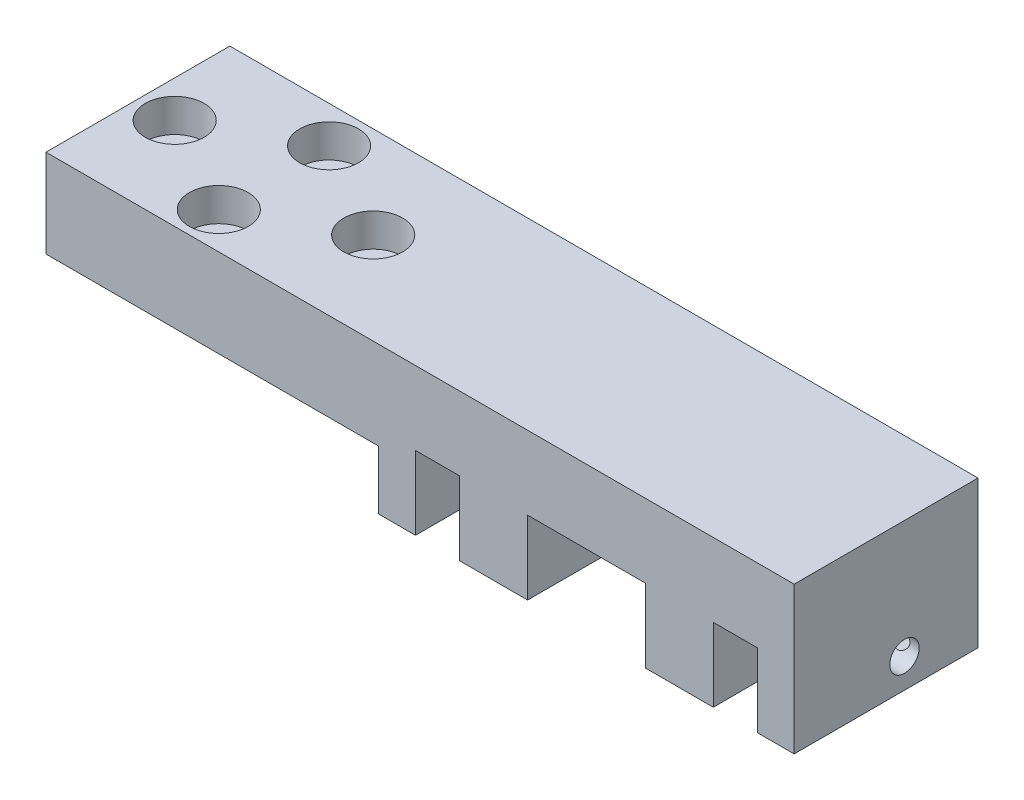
from build123d import *

# Parameters (mm, degrees)
EXTRUDE_1_DEPTH     = 25
SKETCH_2_R          = 2
CUT_EXTRUDE_1_DEPTH = 107.668001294
SKETCH_4_R          = 1.25
CUT_EXTRUDE_2_DEPTH = 10
SKETCH_5_R          = 2.25
CUT_EXTRUDE_3_DEPTH = 107.668001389
SKETCH_6_R          = 4
CUT_EXTRUDE_4_DEPTH = 4.5
SKETCH_8_R          = 1.75
CUT_EXTRUDE_5_DEPTH = 3.5


with BuildPart() as part:
    # Sketch 1 → Extrude 1 (new body)
    with BuildSketch(Plane.XY):
        Polygon((90.75, 0), (90.75, 10), (96.75, 10), (96.75, 0), (101.75, 0), (101.75, 20), (0, 20), (0, 8), (45.25, 8), (45.25, 0), (50.25, 0), (50.25, 10), (56.25, 10), (56.25, 0), (65.5, 0), (65.5, 10), (81.5, 10), (81.5, 0), align=None)
    extrude(amount=EXTRUDE_1_DEPTH)

    # Sketch 2 → Cut-Extrude 1 (cut, through all)
    with BuildSketch(Plane(origin=(101.75, 0, 0), x_dir=(0, 0, -1), z_dir=(1, 0, 0))):
        with Locations((-10, 4)):
            Circle(SKETCH_2_R)
    extrude(amount=-CUT_EXTRUDE_1_DEPTH, mode=Mode.SUBTRACT)

    # Sketch 4 → Cut-Extrude 2 (cut)
    with BuildSketch(Plane(origin=(0, 0, 0), x_dir=(-1, 0, 0), z_dir=(0, 0, -1))):
        with Locations((-99.25, 4)):
            Circle(SKETCH_4_R)
        with Locations((-85.75, 4)):
            Circle(SKETCH_4_R)
        with Locations((-61.25, 4)):
            Circle(SKETCH_4_R)
        with Locations((-47.75, 4)):
            Circle(SKETCH_4_R)
    extrude(amount=-CUT_EXTRUDE_2_DEPTH, mode=Mode.SUBTRACT)

    # Sketch 5 → Cut-Extrude 3 (cut, through all)
    with BuildSketch(Plane(origin=(0, 20, 0), x_dir=(1, 0, 0), z_dir=(0, 1, 0))):
        with Locations(Location((18.5, -5, 0), (0, 0, 270))):
            Circle(SKETCH_5_R)
        with Locations(Location((18.5, -20, 0), (0, 0, 270))):
            Circle(SKETCH_5_R)
        with Locations(Location((5, -12.5, 0), (0, 0, 270))):
            Circle(SKETCH_5_R)
        with Locations(Location((32, -12.5, 0), (0, 0, 270))):
            Circle(SKETCH_5_R)
    extrude(amount=-CUT_EXTRUDE_3_DEPTH, mode=Mode.SUBTRACT)

    # Sketch 6 → Cut-Extrude 4 (cut)
    with BuildSketch(Plane(origin=(0, 20, 0), x_dir=(1, 0, 0), z_dir=(0, 1, 0))):
        with Locations(Location((18.5, -5, 0), (0, 0, 270))):
            Circle(SKETCH_6_R)
        with Locations(Location((18.5, -20, 0), (0, 0, 270))):
            Circle(SKETCH_6_R)
        with Locations(Location((5, -12.5, 0), (0, 0, 270))):
            Circle(SKETCH_6_R)
        with Locations(Location((32, -12.5, 0), (0, 0, 270))):
            Circle(SKETCH_6_R)
    extrude(amount=-CUT_EXTRUDE_4_DEPTH, mode=Mode.SUBTRACT)

    # Sketch 8 → Cut-Extrude 5 (cut)
    with BuildSketch(Plane.XZ.offset(-10)):
        with Locations((53.25, 20)):
            Circle(SKETCH_8_R)
        with Locations((93.75, 20)):
            Circle(SKETCH_8_R)
    extrude(amount=-CUT_EXTRUDE_5_DEPTH, mode=Mode.SUBTRACT)


solid = part.part
